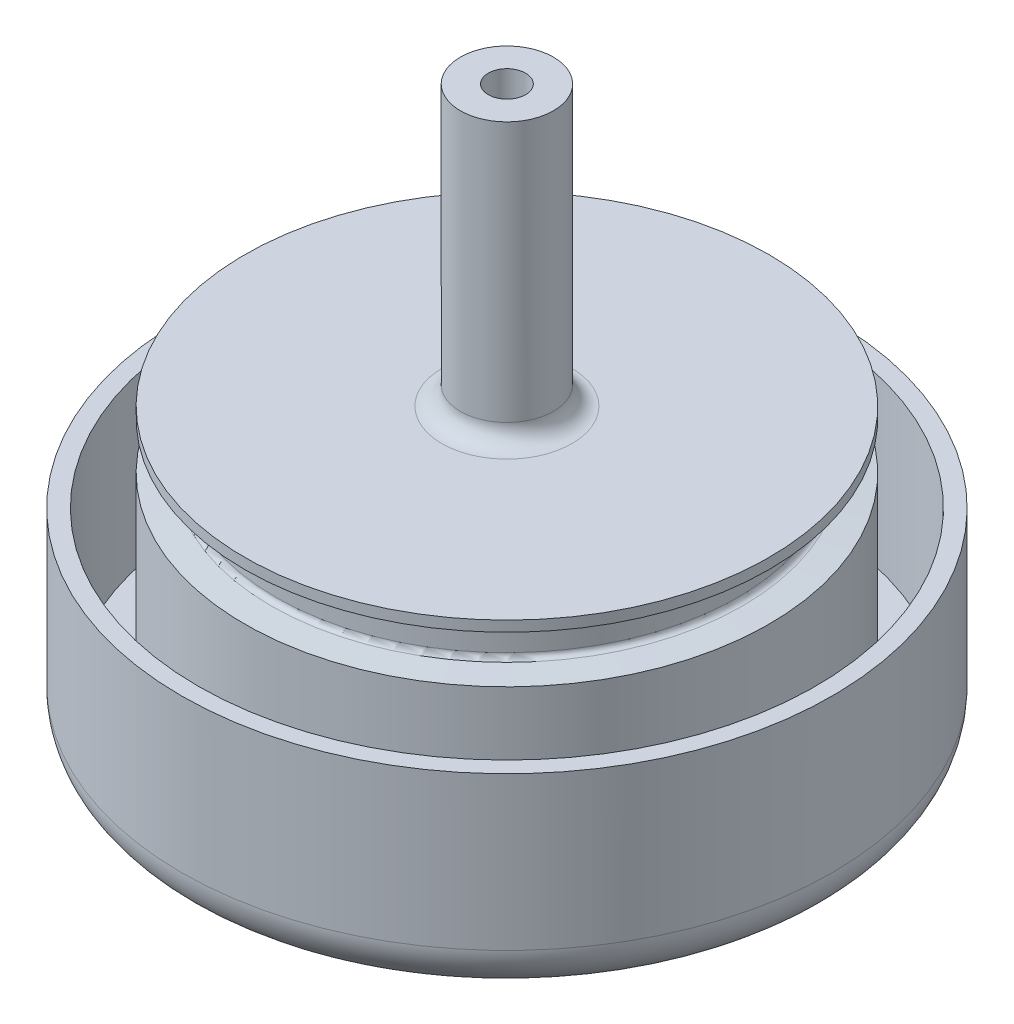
ISO-10303-21;
HEADER;
FILE_DESCRIPTION(('STEP AP214'),'2;1');
FILE_NAME('part.step','',(''),(''),'','','');
FILE_SCHEMA(('AUTOMOTIVE_DESIGN { 1 0 10303 214 1 1 1 1 }'));
ENDSEC;
DATA;
#1=APPLICATION_CONTEXT('core data for automotive mechanical design processes');
#2=APPLICATION_PROTOCOL_DEFINITION('international standard','automotive_design',2000,#1);
#3=PRODUCT_CONTEXT('',#1,'mechanical');
#4=PRODUCT('Part','Part','',(#3));
#5=PRODUCT_RELATED_PRODUCT_CATEGORY('part','',(#4));
#6=PRODUCT_DEFINITION_FORMATION('','',#4);
#7=PRODUCT_DEFINITION_CONTEXT('part definition',#1,'design');
#8=PRODUCT_DEFINITION('design','',#6,#7);
#9=PRODUCT_DEFINITION_SHAPE('','',#8);
#10=(LENGTH_UNIT() NAMED_UNIT(*) SI_UNIT(.MILLI.,.METRE.));
#11=(NAMED_UNIT(*) PLANE_ANGLE_UNIT() SI_UNIT($,.RADIAN.));
#12=(NAMED_UNIT(*) SI_UNIT($,.STERADIAN.) SOLID_ANGLE_UNIT());
#13=UNCERTAINTY_MEASURE_WITH_UNIT(LENGTH_MEASURE(1.E-05),#10,'distance_accuracy_value','');
#14=(GEOMETRIC_REPRESENTATION_CONTEXT(3) GLOBAL_UNCERTAINTY_ASSIGNED_CONTEXT((#13)) GLOBAL_UNIT_ASSIGNED_CONTEXT((#10,
#11,#12)) REPRESENTATION_CONTEXT('',''));
#15=CARTESIAN_POINT('',(0.,0.,0.));
#16=DIRECTION('',(0.,0.,1.));
#17=DIRECTION('',(1.,0.,0.));
#18=AXIS2_PLACEMENT_3D('',#15,#16,#17);
#19=CARTESIAN_POINT('',(0.,9.525,0.));
#20=DIRECTION('',(0.,1.,0.));
#21=DIRECTION('',(0.,0.,1.));
#22=AXIS2_PLACEMENT_3D('',#19,#20,#21);
#23=PLANE('',#22);
#24=CARTESIAN_POINT('',(0.,9.525,0.));
#25=DIRECTION('',(0.,1.,0.));
#26=DIRECTION('',(0.,0.,1.));
#27=AXIS2_PLACEMENT_3D('',#24,#25,#26);
#28=CIRCLE('',#27,8.89);
#29=CARTESIAN_POINT('',(0.,9.525,8.89));
#30=VERTEX_POINT('',#29);
#31=EDGE_CURVE('E102',#30,#30,#28,.F.);
#32=ORIENTED_EDGE('',*,*,#31,.T.);
#33=EDGE_LOOP('',(#32));
#34=FACE_BOUND('',#33,.T.);
#35=CARTESIAN_POINT('',(0.,9.525,0.));
#36=DIRECTION('',(0.,1.,0.));
#37=DIRECTION('',(0.,0.,1.));
#38=AXIS2_PLACEMENT_3D('',#35,#36,#37);
#39=CIRCLE('',#38,35.814);
#40=CARTESIAN_POINT('',(0.,9.525,-35.814));
#41=VERTEX_POINT('',#40);
#42=EDGE_CURVE('E108',#41,#41,#39,.T.);
#43=ORIENTED_EDGE('',*,*,#42,.T.);
#44=EDGE_LOOP('',(#43));
#45=FACE_BOUND('',#44,.T.);
#46=ADVANCED_FACE('F42',(#34,#45),#23,.T.);
#47=CARTESIAN_POINT('',(0.,9.525,0.));
#48=DIRECTION('',(0.,-1.,0.));
#49=DIRECTION('',(0.,0.,-1.));
#50=AXIS2_PLACEMENT_3D('',#47,#48,#49);
#51=CYLINDRICAL_SURFACE('',#50,35.814);
#52=CARTESIAN_POINT('',(0.,8.08680450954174,0.));
#53=DIRECTION('',(0.,1.,0.));
#54=DIRECTION('',(0.,0.,1.));
#55=AXIS2_PLACEMENT_3D('',#52,#53,#54);
#56=CIRCLE('',#55,35.814);
#57=CARTESIAN_POINT('',(0.,8.08680450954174,-35.814));
#58=VERTEX_POINT('',#57);
#59=EDGE_CURVE('E185',#58,#58,#56,.T.);
#60=CARTESIAN_POINT('',(0.,8.08680450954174,-35.814));
#61=CARTESIAN_POINT('',(0.,8.10178571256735,-35.814));
#62=CARTESIAN_POINT('',(0.,8.11676691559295,-35.814));
#63=CARTESIAN_POINT('',(0.,8.14672932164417,-35.814));
#64=CARTESIAN_POINT('',(0.,8.16171052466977,-35.814));
#65=CARTESIAN_POINT('',(0.,8.19167293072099,-35.814));
#66=CARTESIAN_POINT('',(0.,8.20665413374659,-35.814));
#67=CARTESIAN_POINT('',(0.,8.23661653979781,-35.814));
#68=CARTESIAN_POINT('',(0.,8.25159774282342,-35.814));
#69=CARTESIAN_POINT('',(0.,8.28156014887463,-35.814));
#70=CARTESIAN_POINT('',(0.,8.29654135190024,-35.814));
#71=CARTESIAN_POINT('',(0.,8.32650375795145,-35.814));
#72=CARTESIAN_POINT('',(0.,8.34148496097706,-35.814));
#73=CARTESIAN_POINT('',(0.,8.37144736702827,-35.814));
#74=CARTESIAN_POINT('',(0.,8.38642857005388,-35.814));
#75=CARTESIAN_POINT('',(0.,8.41639097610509,-35.814));
#76=CARTESIAN_POINT('',(0.,8.4313721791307,-35.814));
#77=CARTESIAN_POINT('',(0.,8.46133458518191,-35.814));
#78=CARTESIAN_POINT('',(0.,8.47631578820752,-35.814));
#79=CARTESIAN_POINT('',(0.,8.50627819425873,-35.814));
#80=CARTESIAN_POINT('',(0.,8.52125939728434,-35.814));
#81=CARTESIAN_POINT('',(0.,8.55122180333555,-35.814));
#82=CARTESIAN_POINT('',(0.,8.56620300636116,-35.814));
#83=CARTESIAN_POINT('',(0.,8.59616541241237,-35.814));
#84=CARTESIAN_POINT('',(0.,8.61114661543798,-35.814));
#85=CARTESIAN_POINT('',(0.,8.64110902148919,-35.814));
#86=CARTESIAN_POINT('',(0.,8.6560902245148,-35.814));
#87=CARTESIAN_POINT('',(0.,8.68605263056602,-35.814));
#88=CARTESIAN_POINT('',(0.,8.70103383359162,-35.814));
#89=CARTESIAN_POINT('',(0.,8.73099623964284,-35.814));
#90=CARTESIAN_POINT('',(0.,8.74597744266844,-35.814));
#91=CARTESIAN_POINT('',(0.,8.77593984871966,-35.814));
#92=CARTESIAN_POINT('',(0.,8.79092105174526,-35.814));
#93=CARTESIAN_POINT('',(0.,8.82088345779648,-35.814));
#94=CARTESIAN_POINT('',(0.,8.83586466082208,-35.814));
#95=CARTESIAN_POINT('',(0.,8.8658270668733,-35.814));
#96=CARTESIAN_POINT('',(0.,8.8808082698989,-35.814));
#97=CARTESIAN_POINT('',(0.,8.91077067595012,-35.814));
#98=CARTESIAN_POINT('',(0.,8.92575187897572,-35.814));
#99=CARTESIAN_POINT('',(0.,8.95571428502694,-35.814));
#100=CARTESIAN_POINT('',(0.,8.97069548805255,-35.814));
#101=CARTESIAN_POINT('',(0.,9.00065789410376,-35.814));
#102=CARTESIAN_POINT('',(0.,9.01563909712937,-35.814));
#103=CARTESIAN_POINT('',(0.,9.04560150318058,-35.814));
#104=CARTESIAN_POINT('',(0.,9.06058270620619,-35.814));
#105=CARTESIAN_POINT('',(0.,9.0905451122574,-35.814));
#106=CARTESIAN_POINT('',(0.,9.10552631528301,-35.814));
#107=CARTESIAN_POINT('',(0.,9.13548872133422,-35.814));
#108=CARTESIAN_POINT('',(0.,9.15046992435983,-35.814));
#109=CARTESIAN_POINT('',(0.,9.18043233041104,-35.814));
#110=CARTESIAN_POINT('',(0.,9.19541353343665,-35.814));
#111=CARTESIAN_POINT('',(0.,9.22537593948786,-35.814));
#112=CARTESIAN_POINT('',(0.,9.24035714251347,-35.814));
#113=CARTESIAN_POINT('',(0.,9.27031954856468,-35.814));
#114=CARTESIAN_POINT('',(0.,9.28530075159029,-35.814));
#115=CARTESIAN_POINT('',(0.,9.31526315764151,-35.814));
#116=CARTESIAN_POINT('',(0.,9.33024436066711,-35.814));
#117=CARTESIAN_POINT('',(0.,9.36020676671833,-35.814));
#118=CARTESIAN_POINT('',(0.,9.37518796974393,-35.814));
#119=CARTESIAN_POINT('',(0.,9.40515037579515,-35.814));
#120=CARTESIAN_POINT('',(0.,9.42013157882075,-35.814));
#121=CARTESIAN_POINT('',(0.,9.45009398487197,-35.814));
#122=CARTESIAN_POINT('',(0.,9.46507518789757,-35.814));
#123=CARTESIAN_POINT('',(0.,9.49503759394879,-35.814));
#124=CARTESIAN_POINT('',(0.,9.51001879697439,-35.814));
#125=CARTESIAN_POINT('',(0.,9.525,-35.814));
#126=B_SPLINE_CURVE_WITH_KNOTS('',3,(#60,#61,#62,#63,#64,#65,#66,#67,#68,#69,#70,#71,#72,#73,
#74,#75,#76,#77,#78,#79,#80,#81,#82,#83,#84,#85,#86,#87,#88,#89,#90,#91,#92,#93,#94,#95,#96,#97,
#98,#99,#100,#101,#102,#103,#104,#105,#106,#107,#108,#109,#110,#111,#112,#113,#114,#115,#116,
#117,#118,#119,#120,#121,#122,#123,#124,#125),.UNSPECIFIED.,.F.,.F.,(4,2,2,2,2,2,2,2,2,2,2,2,2,
2,2,2,2,2,2,2,2,2,2,2,2,2,2,2,2,2,2,2,4),(0.,0.0449436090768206,0.0898872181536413,
0.134830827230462,0.179774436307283,0.224718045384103,0.269661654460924,0.314605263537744,
0.359548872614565,0.404492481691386,0.449436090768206,0.494379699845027,0.539323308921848,
0.584266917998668,0.629210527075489,0.67415413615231,0.71909774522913,0.764041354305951,
0.808984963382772,0.853928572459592,0.898872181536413,0.943815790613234,0.988759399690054,
1.03370300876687,1.0786466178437,1.12359022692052,1.16853383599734,1.21347744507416,
1.25842105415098,1.3033646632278,1.34830827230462,1.39325188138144,1.43819549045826),.UNSPECIFIED.);
#127=EDGE_CURVE('BSEAM75',#58,#41,#126,.T.);
#128=ORIENTED_EDGE('',*,*,#59,.T.);
#129=ORIENTED_EDGE('',*,*,#42,.F.);
#130=ORIENTED_EDGE('',*,*,#127,.T.);
#131=ORIENTED_EDGE('',*,*,#127,.F.);
#132=EDGE_LOOP('',(#128,#130,#129,#131));
#133=FACE_BOUND('',#132,.T.);
#134=ADVANCED_FACE('F75',(#133),#51,.T.);
#135=CARTESIAN_POINT('',(0.,47.625,0.));
#136=DIRECTION('',(0.,-1.,0.));
#137=DIRECTION('',(0.,0.,-1.));
#138=AXIS2_PLACEMENT_3D('',#135,#136,#137);
#139=CYLINDRICAL_SURFACE('',#138,6.35);
#140=CARTESIAN_POINT('',(0.,12.065,0.));
#141=DIRECTION('',(0.,1.,0.));
#142=DIRECTION('',(0.,0.,1.));
#143=AXIS2_PLACEMENT_3D('',#140,#141,#142);
#144=CIRCLE('',#143,6.35);
#145=CARTESIAN_POINT('',(0.,12.065,-6.35));
#146=VERTEX_POINT('',#145);
#147=EDGE_CURVE('E105',#146,#146,#144,.T.);
#148=CARTESIAN_POINT('',(0.,47.625,0.));
#149=DIRECTION('',(0.,1.,0.));
#150=DIRECTION('',(0.,0.,1.));
#151=AXIS2_PLACEMENT_3D('',#148,#149,#150);
#152=CIRCLE('',#151,6.35);
#153=CARTESIAN_POINT('',(0.,47.625,-6.35));
#154=VERTEX_POINT('',#153);
#155=EDGE_CURVE('E116',#154,#154,#152,.T.);
#156=CARTESIAN_POINT('',(0.,12.065,-6.35));
#157=CARTESIAN_POINT('',(0.,12.4354166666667,-6.35));
#158=CARTESIAN_POINT('',(0.,12.8058333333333,-6.35));
#159=CARTESIAN_POINT('',(0.,13.5466666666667,-6.35));
#160=CARTESIAN_POINT('',(0.,13.9170833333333,-6.35));
#161=CARTESIAN_POINT('',(0.,14.6579166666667,-6.35));
#162=CARTESIAN_POINT('',(0.,15.0283333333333,-6.35));
#163=CARTESIAN_POINT('',(0.,15.7691666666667,-6.35));
#164=CARTESIAN_POINT('',(0.,16.1395833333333,-6.35));
#165=CARTESIAN_POINT('',(0.,16.8804166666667,-6.35));
#166=CARTESIAN_POINT('',(0.,17.2508333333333,-6.35));
#167=CARTESIAN_POINT('',(0.,17.9916666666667,-6.35));
#168=CARTESIAN_POINT('',(0.,18.3620833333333,-6.35));
#169=CARTESIAN_POINT('',(0.,19.1029166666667,-6.35));
#170=CARTESIAN_POINT('',(0.,19.4733333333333,-6.35));
#171=CARTESIAN_POINT('',(0.,20.2141666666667,-6.35));
#172=CARTESIAN_POINT('',(0.,20.5845833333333,-6.35));
#173=CARTESIAN_POINT('',(0.,21.3254166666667,-6.35));
#174=CARTESIAN_POINT('',(0.,21.6958333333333,-6.35));
#175=CARTESIAN_POINT('',(0.,22.4366666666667,-6.35));
#176=CARTESIAN_POINT('',(0.,22.8070833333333,-6.35));
#177=CARTESIAN_POINT('',(0.,23.5479166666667,-6.35));
#178=CARTESIAN_POINT('',(0.,23.9183333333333,-6.35));
#179=CARTESIAN_POINT('',(0.,24.6591666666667,-6.35));
#180=CARTESIAN_POINT('',(0.,25.0295833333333,-6.35));
#181=CARTESIAN_POINT('',(0.,25.7704166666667,-6.35));
#182=CARTESIAN_POINT('',(0.,26.1408333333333,-6.35));
#183=CARTESIAN_POINT('',(0.,26.8816666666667,-6.35));
#184=CARTESIAN_POINT('',(0.,27.2520833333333,-6.35));
#185=CARTESIAN_POINT('',(0.,27.9929166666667,-6.35));
#186=CARTESIAN_POINT('',(0.,28.3633333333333,-6.35));
#187=CARTESIAN_POINT('',(0.,29.1041666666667,-6.35));
#188=CARTESIAN_POINT('',(0.,29.4745833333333,-6.35));
#189=CARTESIAN_POINT('',(0.,30.2154166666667,-6.35));
#190=CARTESIAN_POINT('',(0.,30.5858333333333,-6.35));
#191=CARTESIAN_POINT('',(0.,31.3266666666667,-6.35));
#192=CARTESIAN_POINT('',(0.,31.6970833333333,-6.35));
#193=CARTESIAN_POINT('',(0.,32.4379166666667,-6.35));
#194=CARTESIAN_POINT('',(0.,32.8083333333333,-6.35));
#195=CARTESIAN_POINT('',(0.,33.5491666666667,-6.35));
#196=CARTESIAN_POINT('',(0.,33.9195833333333,-6.35));
#197=CARTESIAN_POINT('',(0.,34.6604166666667,-6.35));
#198=CARTESIAN_POINT('',(0.,35.0308333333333,-6.35));
#199=CARTESIAN_POINT('',(0.,35.7716666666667,-6.35));
#200=CARTESIAN_POINT('',(0.,36.1420833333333,-6.35));
#201=CARTESIAN_POINT('',(0.,36.8829166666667,-6.35));
#202=CARTESIAN_POINT('',(0.,37.2533333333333,-6.35));
#203=CARTESIAN_POINT('',(0.,37.9941666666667,-6.35));
#204=CARTESIAN_POINT('',(0.,38.3645833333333,-6.35));
#205=CARTESIAN_POINT('',(0.,39.1054166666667,-6.35));
#206=CARTESIAN_POINT('',(0.,39.4758333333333,-6.35));
#207=CARTESIAN_POINT('',(0.,40.2166666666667,-6.35));
#208=CARTESIAN_POINT('',(0.,40.5870833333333,-6.35));
#209=CARTESIAN_POINT('',(0.,41.3279166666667,-6.35));
#210=CARTESIAN_POINT('',(0.,41.6983333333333,-6.35));
#211=CARTESIAN_POINT('',(0.,42.4391666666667,-6.35));
#212=CARTESIAN_POINT('',(0.,42.8095833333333,-6.35));
#213=CARTESIAN_POINT('',(0.,43.5504166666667,-6.35));
#214=CARTESIAN_POINT('',(0.,43.9208333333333,-6.35));
#215=CARTESIAN_POINT('',(0.,44.6616666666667,-6.35));
#216=CARTESIAN_POINT('',(0.,45.0320833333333,-6.35));
#217=CARTESIAN_POINT('',(0.,45.7729166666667,-6.35));
#218=CARTESIAN_POINT('',(0.,46.1433333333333,-6.35));
#219=CARTESIAN_POINT('',(0.,46.8841666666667,-6.35));
#220=CARTESIAN_POINT('',(0.,47.2545833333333,-6.35));
#221=CARTESIAN_POINT('',(0.,47.625,-6.35));
#222=B_SPLINE_CURVE_WITH_KNOTS('',3,(#156,#157,#158,#159,#160,#161,#162,#163,#164,#165,#166,
#167,#168,#169,#170,#171,#172,#173,#174,#175,#176,#177,#178,#179,#180,#181,#182,#183,#184,#185,
#186,#187,#188,#189,#190,#191,#192,#193,#194,#195,#196,#197,#198,#199,#200,#201,#202,#203,#204,
#205,#206,#207,#208,#209,#210,#211,#212,#213,#214,#215,#216,#217,#218,#219,#220,#221),
.UNSPECIFIED.,.F.,.F.,(4,2,2,2,2,2,2,2,2,2,2,2,2,2,2,2,2,2,2,2,2,2,2,2,2,2,2,2,2,2,2,2,4),(0.,
1.11125,2.2225,3.33375,4.445,5.55625,6.6675,7.77875,8.89,10.00125,11.1125,12.22375,13.335,
14.44625,15.5575,16.66875,17.78,18.89125,20.0025,21.11375,22.225,23.33625,24.4475,25.55875,
26.67,27.78125,28.8925,30.00375,31.115,32.22625,33.3375,34.44875,35.56),.UNSPECIFIED.);
#223=EDGE_CURVE('BSEAM81',#146,#154,#222,.T.);
#224=ORIENTED_EDGE('',*,*,#147,.T.);
#225=ORIENTED_EDGE('',*,*,#155,.F.);
#226=ORIENTED_EDGE('',*,*,#223,.T.);
#227=ORIENTED_EDGE('',*,*,#223,.F.);
#228=EDGE_LOOP('',(#224,#226,#225,#227));
#229=FACE_BOUND('',#228,.T.);
#230=ADVANCED_FACE('F81',(#229),#139,.T.);
#231=CARTESIAN_POINT('',(0.,47.625,0.));
#232=DIRECTION('',(0.,1.,0.));
#233=DIRECTION('',(0.,0.,1.));
#234=AXIS2_PLACEMENT_3D('',#231,#232,#233);
#235=PLANE('',#234);
#236=CARTESIAN_POINT('',(0.,47.625,0.));
#237=DIRECTION('',(0.,1.,0.));
#238=DIRECTION('',(0.,0.,1.));
#239=AXIS2_PLACEMENT_3D('',#236,#237,#238);
#240=CIRCLE('',#239,2.55269999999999);
#241=CARTESIAN_POINT('',(0.,47.625,2.55269999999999));
#242=VERTEX_POINT('',#241);
#243=EDGE_CURVE('E161',#242,#242,#240,.T.);
#244=ORIENTED_EDGE('',*,*,#243,.F.);
#245=EDGE_LOOP('',(#244));
#246=FACE_BOUND('',#245,.T.);
#247=ORIENTED_EDGE('',*,*,#155,.T.);
#248=EDGE_LOOP('',(#247));
#249=FACE_BOUND('',#248,.T.);
#250=ADVANCED_FACE('F199',(#246,#249),#235,.T.);
#251=CARTESIAN_POINT('',(0.,1.524,0.));
#252=DIRECTION('',(0.,-1.,0.));
#253=DIRECTION('',(0.,0.,-1.));
#254=AXIS2_PLACEMENT_3D('',#251,#252,#253);
#255=CONICAL_SURFACE('',#254,37.0586,1.48352986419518);
#256=CARTESIAN_POINT('',(0.,1.95154645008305,0.));
#257=DIRECTION('',(0.,1.,0.));
#258=DIRECTION('',(0.,0.,1.));
#259=AXIS2_PLACEMENT_3D('',#256,#257,#258);
#260=CIRCLE('',#259,32.1717217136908);
#261=CARTESIAN_POINT('',(0.,1.95154645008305,32.1717217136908));
#262=VERTEX_POINT('',#261);
#263=EDGE_CURVE('E181',#262,#262,#260,.T.);
#264=ORIENTED_EDGE('',*,*,#263,.F.);
#265=EDGE_LOOP('',(#264));
#266=FACE_BOUND('',#265,.T.);
#267=CARTESIAN_POINT('',(0.,1.63288839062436,0.));
#268=DIRECTION('',(0.,-1.,0.));
#269=DIRECTION('',(0.,0.,-1.));
#270=AXIS2_PLACEMENT_3D('',#267,#268,#269);
#271=CIRCLE('',#270,35.814);
#272=CARTESIAN_POINT('',(0.,1.63288839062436,-35.814));
#273=VERTEX_POINT('',#272);
#274=EDGE_CURVE('E119',#273,#273,#271,.T.);
#275=ORIENTED_EDGE('',*,*,#274,.F.);
#276=EDGE_LOOP('',(#275));
#277=FACE_BOUND('',#276,.T.);
#278=ADVANCED_FACE('F196',(#266,#277),#255,.T.);
#279=CARTESIAN_POINT('',(0.,7.76814645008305,0.));
#280=DIRECTION('',(0.,1.,0.));
#281=DIRECTION('',(0.,0.,1.));
#282=AXIS2_PLACEMENT_3D('',#279,#280,#281);
#283=CONICAL_SURFACE('',#282,32.1717217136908,1.48352986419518);
#284=CARTESIAN_POINT('',(0.,7.76814645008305,0.));
#285=DIRECTION('',(0.,1.,0.));
#286=DIRECTION('',(0.,0.,1.));
#287=AXIS2_PLACEMENT_3D('',#284,#285,#286);
#288=CIRCLE('',#287,32.1717217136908);
#289=CARTESIAN_POINT('',(0.,7.76814645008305,32.1717217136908));
#290=VERTEX_POINT('',#289);
#291=EDGE_CURVE('E177',#290,#290,#288,.T.);
#292=ORIENTED_EDGE('',*,*,#291,.T.);
#293=EDGE_LOOP('',(#292));
#294=FACE_BOUND('',#293,.T.);
#295=ORIENTED_EDGE('',*,*,#59,.F.);
#296=EDGE_LOOP('',(#295));
#297=FACE_BOUND('',#296,.T.);
#298=ADVANCED_FACE('F198',(#294,#297),#283,.T.);
#299=CARTESIAN_POINT('',(0.,2.64738844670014,0.));
#300=DIRECTION('',(0.,1.,0.));
#301=DIRECTION('',(0.,0.,1.));
#302=AXIS2_PLACEMENT_3D('',#299,#300,#301);
#303=TOROIDAL_SURFACE('',#302,32.2326,0.698500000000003);
#304=CARTESIAN_POINT('',(0.,2.64738844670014,0.));
#305=DIRECTION('',(0.,1.,0.));
#306=DIRECTION('',(0.,0.,1.));
#307=AXIS2_PLACEMENT_3D('',#304,#305,#306);
#308=CIRCLE('',#307,31.5341);
#309=CARTESIAN_POINT('',(0.,2.64738844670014,31.5341));
#310=VERTEX_POINT('',#309);
#311=EDGE_CURVE('E169',#310,#310,#308,.T.);
#312=ORIENTED_EDGE('',*,*,#311,.F.);
#313=EDGE_LOOP('',(#312));
#314=FACE_BOUND('',#313,.T.);
#315=ORIENTED_EDGE('',*,*,#263,.T.);
#316=EDGE_LOOP('',(#315));
#317=FACE_BOUND('',#316,.T.);
#318=ADVANCED_FACE('F206',(#314,#317),#303,.F.);
#319=CARTESIAN_POINT('',(0.,7.07230445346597,0.));
#320=DIRECTION('',(0.,1.,0.));
#321=DIRECTION('',(0.,0.,1.));
#322=AXIS2_PLACEMENT_3D('',#319,#320,#321);
#323=TOROIDAL_SURFACE('',#322,32.2326,0.698499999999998);
#324=ORIENTED_EDGE('',*,*,#291,.F.);
#325=EDGE_LOOP('',(#324));
#326=FACE_BOUND('',#325,.T.);
#327=CARTESIAN_POINT('',(0.,7.07230445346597,0.));
#328=DIRECTION('',(0.,1.,0.));
#329=DIRECTION('',(0.,0.,1.));
#330=AXIS2_PLACEMENT_3D('',#327,#328,#329);
#331=CIRCLE('',#330,31.5341);
#332=CARTESIAN_POINT('',(0.,7.07230445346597,31.5341));
#333=VERTEX_POINT('',#332);
#334=EDGE_CURVE('E173',#333,#333,#331,.T.);
#335=ORIENTED_EDGE('',*,*,#334,.T.);
#336=EDGE_LOOP('',(#335));
#337=FACE_BOUND('',#336,.T.);
#338=ADVANCED_FACE('F214',(#326,#337),#323,.F.);
#339=CARTESIAN_POINT('',(0.,-40.475,0.));
#340=DIRECTION('',(0.,1.,0.));
#341=DIRECTION('',(0.,0.,1.));
#342=AXIS2_PLACEMENT_3D('',#339,#340,#341);
#343=CYLINDRICAL_SURFACE('',#342,31.5341);
#344=ORIENTED_EDGE('',*,*,#334,.F.);
#345=EDGE_LOOP('',(#344));
#346=FACE_BOUND('',#345,.T.);
#347=ORIENTED_EDGE('',*,*,#311,.T.);
#348=EDGE_LOOP('',(#347));
#349=FACE_BOUND('',#348,.T.);
#350=ADVANCED_FACE('F98',(#346,#349),#343,.T.);
#351=CARTESIAN_POINT('',(0.,-25.4,0.));
#352=DIRECTION('',(0.,1.,0.));
#353=DIRECTION('',(0.,0.,1.));
#354=AXIS2_PLACEMENT_3D('',#351,#352,#353);
#355=CIRCLE('',#354,35.814);
#356=CARTESIAN_POINT('',(0.,-25.4,-35.814));
#357=VERTEX_POINT('',#356);
#358=EDGE_CURVE('E365',#357,#357,#355,.T.);
#359=CARTESIAN_POINT('',(0.,1.63288839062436,-35.814));
#360=CARTESIAN_POINT('',(0.,1.35129580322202,-35.814));
#361=CARTESIAN_POINT('',(0.,1.06970321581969,-35.814));
#362=CARTESIAN_POINT('',(0.,0.506518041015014,-35.814));
#363=CARTESIAN_POINT('',(0.,0.224925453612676,-35.814));
#364=CARTESIAN_POINT('',(0.,-0.338259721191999,-35.814));
#365=CARTESIAN_POINT('',(0.,-0.619852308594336,-35.814));
#366=CARTESIAN_POINT('',(0.,-1.18303748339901,-35.814));
#367=CARTESIAN_POINT('',(0.,-1.46463007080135,-35.814));
#368=CARTESIAN_POINT('',(0.,-2.02781524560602,-35.814));
#369=CARTESIAN_POINT('',(0.,-2.30940783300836,-35.814));
#370=CARTESIAN_POINT('',(0.,-2.87259300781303,-35.814));
#371=CARTESIAN_POINT('',(0.,-3.15418559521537,-35.814));
#372=CARTESIAN_POINT('',(0.,-3.71737077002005,-35.814));
#373=CARTESIAN_POINT('',(0.,-3.99896335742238,-35.814));
#374=CARTESIAN_POINT('',(0.,-4.56214853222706,-35.814));
#375=CARTESIAN_POINT('',(0.,-4.84374111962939,-35.814));
#376=CARTESIAN_POINT('',(0.,-5.40692629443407,-35.814));
#377=CARTESIAN_POINT('',(0.,-5.6885188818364,-35.814));
#378=CARTESIAN_POINT('',(0.,-6.25170405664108,-35.814));
#379=CARTESIAN_POINT('',(0.,-6.53329664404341,-35.814));
#380=CARTESIAN_POINT('',(0.,-7.09648181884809,-35.814));
#381=CARTESIAN_POINT('',(0.,-7.37807440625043,-35.814));
#382=CARTESIAN_POINT('',(0.,-7.9412595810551,-35.814));
#383=CARTESIAN_POINT('',(0.,-8.22285216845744,-35.814));
#384=CARTESIAN_POINT('',(0.,-8.78603734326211,-35.814));
#385=CARTESIAN_POINT('',(0.,-9.06762993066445,-35.814));
#386=CARTESIAN_POINT('',(0.,-9.63081510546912,-35.814));
#387=CARTESIAN_POINT('',(0.,-9.91240769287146,-35.814));
#388=CARTESIAN_POINT('',(0.,-10.4755928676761,-35.814));
#389=CARTESIAN_POINT('',(0.,-10.7571854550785,-35.814));
#390=CARTESIAN_POINT('',(0.,-11.3203706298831,-35.814));
#391=CARTESIAN_POINT('',(0.,-11.6019632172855,-35.814));
#392=CARTESIAN_POINT('',(0.,-12.1651483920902,-35.814));
#393=CARTESIAN_POINT('',(0.,-12.4467409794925,-35.814));
#394=CARTESIAN_POINT('',(0.,-13.0099261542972,-35.814));
#395=CARTESIAN_POINT('',(0.,-13.2915187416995,-35.814));
#396=CARTESIAN_POINT('',(0.,-13.8547039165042,-35.814));
#397=CARTESIAN_POINT('',(0.,-14.1362965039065,-35.814));
#398=CARTESIAN_POINT('',(0.,-14.6994816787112,-35.814));
#399=CARTESIAN_POINT('',(0.,-14.9810742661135,-35.814));
#400=CARTESIAN_POINT('',(0.,-15.5442594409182,-35.814));
#401=CARTESIAN_POINT('',(0.,-15.8258520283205,-35.814));
#402=CARTESIAN_POINT('',(0.,-16.3890372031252,-35.814));
#403=CARTESIAN_POINT('',(0.,-16.6706297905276,-35.814));
#404=CARTESIAN_POINT('',(0.,-17.2338149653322,-35.814));
#405=CARTESIAN_POINT('',(0.,-17.5154075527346,-35.814));
#406=CARTESIAN_POINT('',(0.,-18.0785927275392,-35.814));
#407=CARTESIAN_POINT('',(0.,-18.3601853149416,-35.814));
#408=CARTESIAN_POINT('',(0.,-18.9233704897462,-35.814));
#409=CARTESIAN_POINT('',(0.,-19.2049630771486,-35.814));
#410=CARTESIAN_POINT('',(0.,-19.7681482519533,-35.814));
#411=CARTESIAN_POINT('',(0.,-20.0497408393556,-35.814));
#412=CARTESIAN_POINT('',(0.,-20.6129260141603,-35.814));
#413=CARTESIAN_POINT('',(0.,-20.8945186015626,-35.814));
#414=CARTESIAN_POINT('',(0.,-21.4577037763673,-35.814));
#415=CARTESIAN_POINT('',(0.,-21.7392963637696,-35.814));
#416=CARTESIAN_POINT('',(0.,-22.3024815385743,-35.814));
#417=CARTESIAN_POINT('',(0.,-22.5840741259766,-35.814));
#418=CARTESIAN_POINT('',(0.,-23.1472593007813,-35.814));
#419=CARTESIAN_POINT('',(0.,-23.4288518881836,-35.814));
#420=CARTESIAN_POINT('',(0.,-23.9920370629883,-35.814));
#421=CARTESIAN_POINT('',(0.,-24.2736296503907,-35.814));
#422=CARTESIAN_POINT('',(0.,-24.8368148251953,-35.814));
#423=CARTESIAN_POINT('',(0.,-25.1184074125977,-35.814));
#424=CARTESIAN_POINT('',(0.,-25.4,-35.814));
#425=B_SPLINE_CURVE_WITH_KNOTS('',3,(#359,#360,#361,#362,#363,#364,#365,#366,#367,#368,#369,
#370,#371,#372,#373,#374,#375,#376,#377,#378,#379,#380,#381,#382,#383,#384,#385,#386,#387,#388,
#389,#390,#391,#392,#393,#394,#395,#396,#397,#398,#399,#400,#401,#402,#403,#404,#405,#406,#407,
#408,#409,#410,#411,#412,#413,#414,#415,#416,#417,#418,#419,#420,#421,#422,#423,#424),
.UNSPECIFIED.,.F.,.F.,(4,2,2,2,2,2,2,2,2,2,2,2,2,2,2,2,2,2,2,2,2,2,2,2,2,2,2,2,2,2,2,2,4),(0.,
0.844777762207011,1.68955552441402,2.53433328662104,3.37911104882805,4.22388881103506,
5.06866657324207,5.91344433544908,6.75822209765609,7.6029998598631,8.44777762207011,
9.29255538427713,10.1373331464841,10.9821109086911,11.8268886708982,12.6716664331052,
13.5164441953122,14.3612219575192,15.2059997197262,16.0507774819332,16.8955552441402,
17.7403330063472,18.5851107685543,19.4298885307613,20.2746662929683,21.1194440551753,
21.9642218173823,22.8089995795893,23.6537773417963,24.4985551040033,25.3433328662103,
26.1881106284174,27.0328883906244),.UNSPECIFIED.);
#426=EDGE_CURVE('BSEAM84',#273,#357,#425,.T.);
#427=ORIENTED_EDGE('',*,*,#274,.T.);
#428=ORIENTED_EDGE('',*,*,#358,.T.);
#429=ORIENTED_EDGE('',*,*,#426,.T.);
#430=ORIENTED_EDGE('',*,*,#426,.F.);
#431=EDGE_LOOP('',(#427,#429,#428,#430));
#432=FACE_BOUND('',#431,.T.);
#433=ADVANCED_FACE('F84',(#432),#51,.T.);
#434=CARTESIAN_POINT('',(0.,12.065,0.));
#435=DIRECTION('',(0.,1.,0.));
#436=DIRECTION('',(0.,0.,1.));
#437=AXIS2_PLACEMENT_3D('',#434,#435,#436);
#438=TOROIDAL_SURFACE('',#437,8.89,2.54);
#439=ORIENTED_EDGE('',*,*,#31,.F.);
#440=EDGE_LOOP('',(#439));
#441=FACE_BOUND('',#440,.T.);
#442=ORIENTED_EDGE('',*,*,#147,.F.);
#443=EDGE_LOOP('',(#442));
#444=FACE_BOUND('',#443,.T.);
#445=ADVANCED_FACE('F89',(#441,#444),#438,.F.);
#446=CARTESIAN_POINT('',(0.,47.625,0.));
#447=DIRECTION('',(0.,1.,0.));
#448=DIRECTION('',(0.,0.,1.));
#449=AXIS2_PLACEMENT_3D('',#446,#447,#448);
#450=CYLINDRICAL_SURFACE('',#449,2.55269999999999);
#451=CARTESIAN_POINT('',(0.,31.623,0.));
#452=DIRECTION('',(0.,1.,0.));
#453=DIRECTION('',(0.,0.,1.));
#454=AXIS2_PLACEMENT_3D('',#451,#452,#453);
#455=CIRCLE('',#454,2.5527);
#456=CARTESIAN_POINT('',(0.,31.623,2.5527));
#457=VERTEX_POINT('',#456);
#458=EDGE_CURVE('E157',#457,#457,#455,.T.);
#459=ORIENTED_EDGE('',*,*,#458,.F.);
#460=EDGE_LOOP('',(#459));
#461=FACE_BOUND('',#460,.T.);
#462=ORIENTED_EDGE('',*,*,#243,.T.);
#463=EDGE_LOOP('',(#462));
#464=FACE_BOUND('',#463,.T.);
#465=ADVANCED_FACE('F72',(#461,#464),#450,.F.);
#466=CARTESIAN_POINT('',(0.,31.623,0.));
#467=DIRECTION('',(0.,1.,0.));
#468=DIRECTION('',(0.,0.,1.));
#469=AXIS2_PLACEMENT_3D('',#466,#467,#468);
#470=CONICAL_SURFACE('',#469,2.5527,1.02974425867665);
#471=CARTESIAN_POINT('',(0.,30.0891830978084,0.));
#472=VERTEX_POINT('',#471);
#473=VERTEX_LOOP('',#472);
#474=FACE_BOUND('',#473,.T.);
#475=ORIENTED_EDGE('',*,*,#458,.T.);
#476=EDGE_LOOP('',(#475));
#477=FACE_BOUND('',#476,.T.);
#478=ADVANCED_FACE('F62',(#474,#477),#470,.F.);
#479=CARTESIAN_POINT('',(0.,-38.1,0.));
#480=DIRECTION('',(0.,1.,0.));
#481=DIRECTION('',(0.,0.,1.));
#482=AXIS2_PLACEMENT_3D('',#479,#480,#481);
#483=CONICAL_SURFACE('',#482,0.,1.35970299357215);
#484=CARTESIAN_POINT('',(0.,-29.6506050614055,0.));
#485=DIRECTION('',(0.,-1.,0.));
#486=DIRECTION('',(0.,0.,-1.));
#487=AXIS2_PLACEMENT_3D('',#484,#485,#486);
#488=CIRCLE('',#487,39.430509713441);
#489=CARTESIAN_POINT('',(0.,-29.6506050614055,-39.430509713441));
#490=VERTEX_POINT('',#489);
#491=EDGE_CURVE('E11',#490,#490,#488,.T.);
#492=ORIENTED_EDGE('',*,*,#491,.T.);
#493=EDGE_LOOP('',(#492));
#494=FACE_BOUND('',#493,.T.);
#495=CARTESIAN_POINT('',(0.,-38.1,0.));
#496=VERTEX_POINT('',#495);
#497=VERTEX_LOOP('',#496);
#498=FACE_BOUND('',#497,.T.);
#499=ADVANCED_FACE('F59',(#494,#498),#483,.T.);
#500=CARTESIAN_POINT('',(0.,-40.475,0.));
#501=DIRECTION('',(0.,1.,0.));
#502=DIRECTION('',(0.,0.,1.));
#503=AXIS2_PLACEMENT_3D('',#500,#501,#502);
#504=CYLINDRICAL_SURFACE('',#503,44.45);
#505=CARTESIAN_POINT('',(0.,-23.4415597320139,0.));
#506=DIRECTION('',(0.,-1.,0.));
#507=DIRECTION('',(0.,0.,-1.));
#508=AXIS2_PLACEMENT_3D('',#505,#506,#507);
#509=CIRCLE('',#508,44.45);
#510=CARTESIAN_POINT('',(0.,-23.4415597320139,-44.45));
#511=VERTEX_POINT('',#510);
#512=EDGE_CURVE('E51',#511,#511,#509,.F.);
#513=ORIENTED_EDGE('',*,*,#512,.T.);
#514=EDGE_LOOP('',(#513));
#515=FACE_BOUND('',#514,.T.);
#516=CARTESIAN_POINT('',(0.,-2.53999999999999,0.));
#517=DIRECTION('',(0.,1.,0.));
#518=DIRECTION('',(0.,0.,1.));
#519=AXIS2_PLACEMENT_3D('',#516,#517,#518);
#520=CIRCLE('',#519,44.45);
#521=CARTESIAN_POINT('',(0.,-2.53999999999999,44.45));
#522=VERTEX_POINT('',#521);
#523=EDGE_CURVE('E156',#522,#522,#520,.T.);
#524=ORIENTED_EDGE('',*,*,#523,.F.);
#525=EDGE_LOOP('',(#524));
#526=FACE_BOUND('',#525,.T.);
#527=ADVANCED_FACE('F61',(#515,#526),#504,.T.);
#528=CARTESIAN_POINT('',(42.164,-2.54,0.));
#529=DIRECTION('',(0.,-1.,0.));
#530=DIRECTION('',(0.,0.,-1.));
#531=AXIS2_PLACEMENT_3D('',#528,#529,#530);
#532=PLANE('',#531);
#533=CARTESIAN_POINT('',(0.,-2.54,0.));
#534=DIRECTION('',(0.,1.,0.));
#535=DIRECTION('',(0.,0.,1.));
#536=AXIS2_PLACEMENT_3D('',#533,#534,#535);
#537=CIRCLE('',#536,42.164);
#538=CARTESIAN_POINT('',(0.,-2.54,42.164));
#539=VERTEX_POINT('',#538);
#540=EDGE_CURVE('E153',#539,#539,#537,.T.);
#541=ORIENTED_EDGE('',*,*,#540,.F.);
#542=EDGE_LOOP('',(#541));
#543=FACE_BOUND('',#542,.T.);
#544=ORIENTED_EDGE('',*,*,#523,.T.);
#545=EDGE_LOOP('',(#544));
#546=FACE_BOUND('',#545,.T.);
#547=ADVANCED_FACE('F69',(#543,#546),#532,.F.);
#548=CARTESIAN_POINT('',(0.,-40.475,0.));
#549=DIRECTION('',(0.,1.,0.));
#550=DIRECTION('',(0.,0.,1.));
#551=AXIS2_PLACEMENT_3D('',#548,#549,#550);
#552=CYLINDRICAL_SURFACE('',#551,42.164);
#553=CARTESIAN_POINT('',(0.,-25.4,0.));
#554=DIRECTION('',(0.,1.,0.));
#555=DIRECTION('',(0.,0.,1.));
#556=AXIS2_PLACEMENT_3D('',#553,#554,#555);
#557=CIRCLE('',#556,42.164);
#558=CARTESIAN_POINT('',(0.,-25.4,42.164));
#559=VERTEX_POINT('',#558);
#560=EDGE_CURVE('E163',#559,#559,#557,.T.);
#561=ORIENTED_EDGE('',*,*,#560,.F.);
#562=EDGE_LOOP('',(#561));
#563=FACE_BOUND('',#562,.T.);
#564=ORIENTED_EDGE('',*,*,#540,.T.);
#565=EDGE_LOOP('',(#564));
#566=FACE_BOUND('',#565,.T.);
#567=ADVANCED_FACE('F134',(#563,#566),#552,.F.);
#568=CARTESIAN_POINT('',(35.814,-25.4,0.));
#569=DIRECTION('',(0.,-1.,0.));
#570=DIRECTION('',(0.,0.,-1.));
#571=AXIS2_PLACEMENT_3D('',#568,#569,#570);
#572=PLANE('',#571);
#573=ORIENTED_EDGE('',*,*,#358,.F.);
#574=EDGE_LOOP('',(#573));
#575=FACE_BOUND('',#574,.T.);
#576=ORIENTED_EDGE('',*,*,#560,.T.);
#577=EDGE_LOOP('',(#576));
#578=FACE_BOUND('',#577,.T.);
#579=ADVANCED_FACE('F129',(#575,#578),#572,.F.);
#580=CARTESIAN_POINT('',(0.,-23.4415597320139,0.));
#581=DIRECTION('',(0.,-1.,0.));
#582=DIRECTION('',(0.,0.,-1.));
#583=AXIS2_PLACEMENT_3D('',#580,#581,#582);
#584=TOROIDAL_SURFACE('',#583,38.1,6.35);
#585=ORIENTED_EDGE('',*,*,#491,.F.);
#586=EDGE_LOOP('',(#585));
#587=FACE_BOUND('',#586,.T.);
#588=ORIENTED_EDGE('',*,*,#512,.F.);
#589=EDGE_LOOP('',(#588));
#590=FACE_BOUND('',#589,.T.);
#591=ADVANCED_FACE('F44',(#587,#590),#584,.T.);
#592=CLOSED_SHELL('',(#46,#134,#230,#250,#278,#298,#318,#338,#350,#433,#445,#465,#478,#499,#527,
#547,#567,#579,#591));
#593=MANIFOLD_SOLID_BREP('B2',#592);
#594=ADVANCED_BREP_SHAPE_REPRESENTATION('',(#18,#593),#14);
#595=SHAPE_DEFINITION_REPRESENTATION(#9,#594);
ENDSEC;
END-ISO-10303-21;
